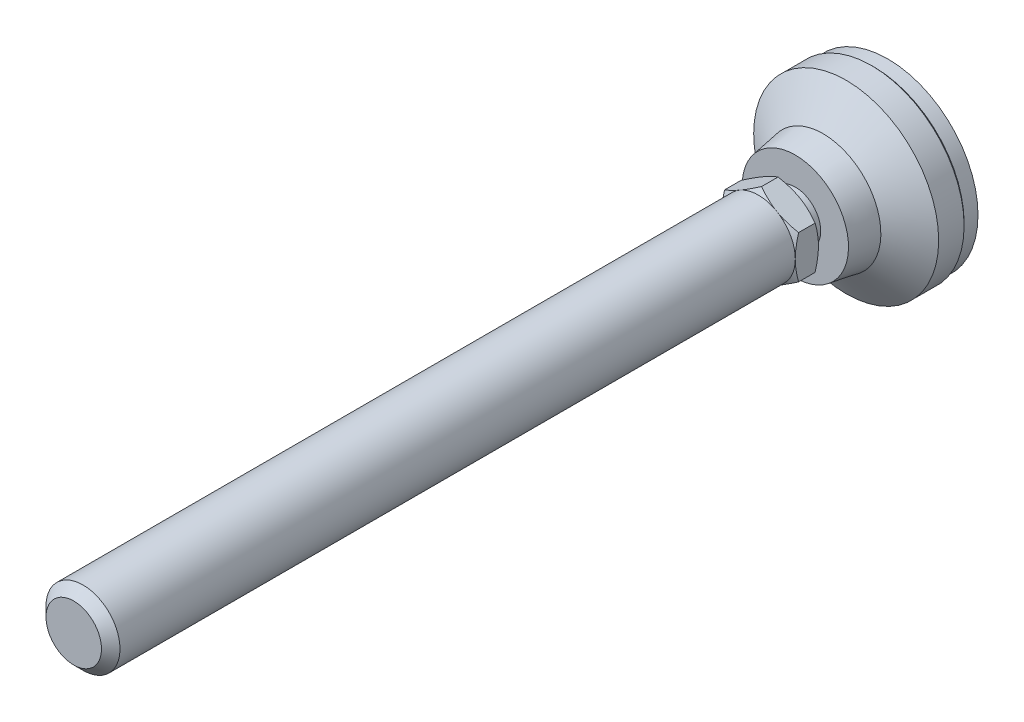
ISO-10303-21;
HEADER;
FILE_DESCRIPTION(('STEP AP214'),'2;1');
FILE_NAME('part.step','',(''),(''),'','','');
FILE_SCHEMA(('AUTOMOTIVE_DESIGN { 1 0 10303 214 1 1 1 1 }'));
ENDSEC;
DATA;
#1=APPLICATION_CONTEXT('core data for automotive mechanical design processes');
#2=APPLICATION_PROTOCOL_DEFINITION('international standard','automotive_design',2000,#1);
#3=PRODUCT_CONTEXT('',#1,'mechanical');
#4=PRODUCT('Part','Part','',(#3));
#5=PRODUCT_RELATED_PRODUCT_CATEGORY('part','',(#4));
#6=PRODUCT_DEFINITION_FORMATION('','',#4);
#7=PRODUCT_DEFINITION_CONTEXT('part definition',#1,'design');
#8=PRODUCT_DEFINITION('design','',#6,#7);
#9=PRODUCT_DEFINITION_SHAPE('','',#8);
#10=(LENGTH_UNIT() NAMED_UNIT(*) SI_UNIT(.MILLI.,.METRE.));
#11=(NAMED_UNIT(*) PLANE_ANGLE_UNIT() SI_UNIT($,.RADIAN.));
#12=(NAMED_UNIT(*) SI_UNIT($,.STERADIAN.) SOLID_ANGLE_UNIT());
#13=UNCERTAINTY_MEASURE_WITH_UNIT(LENGTH_MEASURE(1.E-05),#10,'distance_accuracy_value','');
#14=(GEOMETRIC_REPRESENTATION_CONTEXT(3) GLOBAL_UNCERTAINTY_ASSIGNED_CONTEXT((#13)) GLOBAL_UNIT_ASSIGNED_CONTEXT((#10,
#11,#12)) REPRESENTATION_CONTEXT('',''));
#15=CARTESIAN_POINT('',(0.,0.,0.));
#16=DIRECTION('',(0.,0.,1.));
#17=DIRECTION('',(1.,0.,0.));
#18=AXIS2_PLACEMENT_3D('',#15,#16,#17);
#19=CARTESIAN_POINT('',(0.,0.,2.));
#20=DIRECTION('',(0.,0.,-1.));
#21=DIRECTION('',(0.,1.,0.));
#22=AXIS2_PLACEMENT_3D('',#19,#20,#21);
#23=CYLINDRICAL_SURFACE('',#22,20.);
#24=CARTESIAN_POINT('',(0.,0.,3.5));
#25=DIRECTION('',(0.,0.,-1.));
#26=DIRECTION('',(0.,1.,0.));
#27=AXIS2_PLACEMENT_3D('',#24,#25,#26);
#28=CIRCLE('',#27,20.);
#29=CARTESIAN_POINT('',(0.,20.,3.5));
#30=VERTEX_POINT('',#29);
#31=EDGE_CURVE('E163',#30,#30,#28,.F.);
#32=ORIENTED_EDGE('',*,*,#31,.T.);
#33=EDGE_LOOP('',(#32));
#34=FACE_BOUND('',#33,.T.);
#35=CARTESIAN_POINT('',(0.,0.,9.));
#36=DIRECTION('',(0.,0.,-1.));
#37=DIRECTION('',(0.,1.,0.));
#38=AXIS2_PLACEMENT_3D('',#35,#36,#37);
#39=CIRCLE('',#38,20.);
#40=CARTESIAN_POINT('',(0.,20.,9.));
#41=VERTEX_POINT('',#40);
#42=EDGE_CURVE('E143',#41,#41,#39,.T.);
#43=ORIENTED_EDGE('',*,*,#42,.T.);
#44=EDGE_LOOP('',(#43));
#45=FACE_BOUND('',#44,.T.);
#46=ADVANCED_FACE('F14',(#34,#45),#23,.T.);
#47=CARTESIAN_POINT('',(0.,0.,2.));
#48=DIRECTION('',(0.,0.,-1.));
#49=DIRECTION('',(0.,1.,0.));
#50=AXIS2_PLACEMENT_3D('',#47,#48,#49);
#51=CYLINDRICAL_SURFACE('',#50,5.50000000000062);
#52=CARTESIAN_POINT('',(0.,0.,20.));
#53=DIRECTION('',(0.,0.,-1.));
#54=DIRECTION('',(0.,1.,0.));
#55=AXIS2_PLACEMENT_3D('',#52,#53,#54);
#56=CIRCLE('',#55,5.50000000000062);
#57=CARTESIAN_POINT('',(0.,5.50000000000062,20.));
#58=VERTEX_POINT('',#57);
#59=EDGE_CURVE('E153',#58,#58,#56,.T.);
#60=ORIENTED_EDGE('',*,*,#59,.F.);
#61=EDGE_LOOP('',(#60));
#62=FACE_BOUND('',#61,.T.);
#63=CARTESIAN_POINT('',(0.,0.,22.9999999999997));
#64=DIRECTION('',(0.,0.,-1.));
#65=DIRECTION('',(0.,1.,0.));
#66=AXIS2_PLACEMENT_3D('',#63,#64,#65);
#67=CIRCLE('',#66,5.50000000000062);
#68=CARTESIAN_POINT('',(0.,5.50000000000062,22.9999999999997));
#69=VERTEX_POINT('',#68);
#70=EDGE_CURVE('E134',#69,#69,#67,.T.);
#71=ORIENTED_EDGE('',*,*,#70,.T.);
#72=EDGE_LOOP('',(#71));
#73=FACE_BOUND('',#72,.T.);
#74=ADVANCED_FACE('F293',(#62,#73),#51,.T.);
#75=CARTESIAN_POINT('',(-11.5,0.,20.));
#76=DIRECTION('',(0.,0.,-1.));
#77=DIRECTION('',(0.,1.,0.));
#78=AXIS2_PLACEMENT_3D('',#75,#76,#77);
#79=PLANE('',#78);
#80=CARTESIAN_POINT('',(0.,0.,20.));
#81=DIRECTION('',(0.,0.,-1.));
#82=DIRECTION('',(0.,1.,0.));
#83=AXIS2_PLACEMENT_3D('',#80,#81,#82);
#84=CIRCLE('',#83,11.5);
#85=CARTESIAN_POINT('',(0.,11.5,20.));
#86=VERTEX_POINT('',#85);
#87=EDGE_CURVE('E150',#86,#86,#84,.T.);
#88=ORIENTED_EDGE('',*,*,#87,.F.);
#89=EDGE_LOOP('',(#88));
#90=FACE_BOUND('',#89,.T.);
#91=ORIENTED_EDGE('',*,*,#59,.T.);
#92=EDGE_LOOP('',(#91));
#93=FACE_BOUND('',#92,.T.);
#94=ADVANCED_FACE('F299',(#90,#93),#79,.F.);
#95=CARTESIAN_POINT('',(0.,0.,20.));
#96=DIRECTION('',(0.,0.,-1.));
#97=DIRECTION('',(0.,1.,0.));
#98=AXIS2_PLACEMENT_3D('',#95,#96,#97);
#99=CONICAL_SURFACE('',#98,11.5,0.165148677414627);
#100=CARTESIAN_POINT('',(0.,0.,14.));
#101=DIRECTION('',(0.,0.,-1.));
#102=DIRECTION('',(0.,1.,0.));
#103=AXIS2_PLACEMENT_3D('',#100,#101,#102);
#104=CIRCLE('',#103,12.5);
#105=CARTESIAN_POINT('',(0.,12.5,14.));
#106=VERTEX_POINT('',#105);
#107=EDGE_CURVE('E146',#106,#106,#104,.T.);
#108=ORIENTED_EDGE('',*,*,#107,.F.);
#109=EDGE_LOOP('',(#108));
#110=FACE_BOUND('',#109,.T.);
#111=ORIENTED_EDGE('',*,*,#87,.T.);
#112=EDGE_LOOP('',(#111));
#113=FACE_BOUND('',#112,.T.);
#114=ADVANCED_FACE('F308',(#110,#113),#99,.T.);
#115=CARTESIAN_POINT('',(0.,0.,14.));
#116=DIRECTION('',(0.,0.,-1.));
#117=DIRECTION('',(0.,1.,0.));
#118=AXIS2_PLACEMENT_3D('',#115,#116,#117);
#119=CONICAL_SURFACE('',#118,12.5,0.982793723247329);
#120=ORIENTED_EDGE('',*,*,#42,.F.);
#121=EDGE_LOOP('',(#120));
#122=FACE_BOUND('',#121,.T.);
#123=ORIENTED_EDGE('',*,*,#107,.T.);
#124=EDGE_LOOP('',(#123));
#125=FACE_BOUND('',#124,.T.);
#126=ADVANCED_FACE('F304',(#122,#125),#119,.T.);
#127=CARTESIAN_POINT('',(0.,-5.50000000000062,22.9999999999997));
#128=DIRECTION('',(0.,0.,-1.));
#129=DIRECTION('',(0.,1.,0.));
#130=AXIS2_PLACEMENT_3D('',#127,#128,#129);
#131=PLANE('',#130);
#132=CARTESIAN_POINT('',(0.,0.,22.9999999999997));
#133=DIRECTION('',(0.,0.,1.));
#134=DIRECTION('',(0.,-1.,0.));
#135=AXIS2_PLACEMENT_3D('',#132,#133,#134);
#136=CIRCLE('',#135,8.00000000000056);
#137=CARTESIAN_POINT('',(-4.,6.92820323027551,22.9999999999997));
#138=VERTEX_POINT('',#137);
#139=CARTESIAN_POINT('',(-8.,0.,22.9999999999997));
#140=VERTEX_POINT('',#139);
#141=EDGE_CURVE('E374',#138,#140,#136,.T.);
#142=ORIENTED_EDGE('',*,*,#141,.F.);
#143=CARTESIAN_POINT('',(4.,6.92820323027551,22.9999999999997));
#144=VERTEX_POINT('',#143);
#145=EDGE_CURVE('E115',#144,#138,#136,.T.);
#146=ORIENTED_EDGE('',*,*,#145,.F.);
#147=CARTESIAN_POINT('',(8.,0.,22.9999999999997));
#148=VERTEX_POINT('',#147);
#149=EDGE_CURVE('E375',#148,#144,#136,.T.);
#150=ORIENTED_EDGE('',*,*,#149,.F.);
#151=CARTESIAN_POINT('',(4.,-6.92820323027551,22.9999999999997));
#152=VERTEX_POINT('',#151);
#153=EDGE_CURVE('E35',#152,#148,#136,.T.);
#154=ORIENTED_EDGE('',*,*,#153,.F.);
#155=CARTESIAN_POINT('',(-4.,-6.92820323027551,22.9999999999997));
#156=VERTEX_POINT('',#155);
#157=EDGE_CURVE('E43',#156,#152,#136,.T.);
#158=ORIENTED_EDGE('',*,*,#157,.F.);
#159=EDGE_CURVE('E367',#140,#156,#136,.T.);
#160=ORIENTED_EDGE('',*,*,#159,.F.);
#161=EDGE_LOOP('',(#142,#146,#150,#154,#158,#160));
#162=FACE_BOUND('',#161,.T.);
#163=ORIENTED_EDGE('',*,*,#70,.F.);
#164=EDGE_LOOP('',(#163));
#165=FACE_BOUND('',#164,.T.);
#166=ADVANCED_FACE('F307',(#162,#165),#131,.T.);
#167=CARTESIAN_POINT('',(0.,0.,3.));
#168=DIRECTION('',(0.,0.,1.));
#169=DIRECTION('',(0.,-1.,0.));
#170=AXIS2_PLACEMENT_3D('',#167,#168,#169);
#171=CONICAL_SURFACE('',#170,19.5,0.785398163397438);
#172=ORIENTED_EDGE('',*,*,#31,.F.);
#173=EDGE_LOOP('',(#172));
#174=FACE_BOUND('',#173,.T.);
#175=CARTESIAN_POINT('',(0.,0.,3.));
#176=DIRECTION('',(0.,0.,-1.));
#177=DIRECTION('',(0.,1.,0.));
#178=AXIS2_PLACEMENT_3D('',#175,#176,#177);
#179=CIRCLE('',#178,19.5);
#180=CARTESIAN_POINT('',(0.,19.5,3.));
#181=VERTEX_POINT('',#180);
#182=EDGE_CURVE('E160',#181,#181,#179,.T.);
#183=ORIENTED_EDGE('',*,*,#182,.F.);
#184=EDGE_LOOP('',(#183));
#185=FACE_BOUND('',#184,.T.);
#186=ADVANCED_FACE('F16',(#174,#185),#171,.T.);
#187=CARTESIAN_POINT('',(0.,0.,0.));
#188=DIRECTION('',(0.,0.,1.));
#189=DIRECTION('',(0.,-1.,0.));
#190=AXIS2_PLACEMENT_3D('',#187,#188,#189);
#191=CYLINDRICAL_SURFACE('',#190,19.5);
#192=CARTESIAN_POINT('',(0.,0.,0.));
#193=DIRECTION('',(0.,0.,-1.));
#194=DIRECTION('',(0.,1.,0.));
#195=AXIS2_PLACEMENT_3D('',#192,#193,#194);
#196=CIRCLE('',#195,19.5);
#197=CARTESIAN_POINT('',(0.,19.5,0.));
#198=VERTEX_POINT('',#197);
#199=EDGE_CURVE('E406',#198,#198,#196,.T.);
#200=ORIENTED_EDGE('',*,*,#199,.F.);
#201=EDGE_LOOP('',(#200));
#202=FACE_BOUND('',#201,.T.);
#203=ORIENTED_EDGE('',*,*,#182,.T.);
#204=EDGE_LOOP('',(#203));
#205=FACE_BOUND('',#204,.T.);
#206=ADVANCED_FACE('F335',(#202,#205),#191,.T.);
#207=CARTESIAN_POINT('',(0.,0.,0.));
#208=DIRECTION('',(0.,0.,-1.));
#209=DIRECTION('',(0.,1.,0.));
#210=AXIS2_PLACEMENT_3D('',#207,#208,#209);
#211=PLANE('',#210);
#212=ORIENTED_EDGE('',*,*,#199,.T.);
#213=EDGE_LOOP('',(#212));
#214=FACE_BOUND('',#213,.T.);
#215=ADVANCED_FACE('F183',(#214),#211,.T.);
#216=CARTESIAN_POINT('',(0.,0.,22.9999999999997));
#217=DIRECTION('',(0.,0.,1.));
#218=DIRECTION('',(0.,-1.,0.));
#219=AXIS2_PLACEMENT_3D('',#216,#217,#218);
#220=CONICAL_SURFACE('',#219,8.00000000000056,1.0471975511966);
#221=CARTESIAN_POINT('',(-0.000199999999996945,9.23771977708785,23.7145978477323));
#222=CARTESIAN_POINT('',(0.175648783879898,9.13619343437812,23.6559907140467));
#223=CARTESIAN_POINT('',(0.352153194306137,9.03428856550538,23.6000434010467));
#224=CARTESIAN_POINT('',(0.706595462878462,8.82965122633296,23.494201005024));
#225=CARTESIAN_POINT('',(0.884533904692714,8.72691841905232,23.4443085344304));
#226=CARTESIAN_POINT('',(1.42119823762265,8.41707512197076,23.3046927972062));
#227=CARTESIAN_POINT('',(1.78204258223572,8.20874154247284,23.2252811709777));
#228=CARTESIAN_POINT('',(2.32203917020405,7.89697436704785,23.1321616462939));
#229=CARTESIAN_POINT('',(2.49957818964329,7.79447216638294,23.1056345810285));
#230=CARTESIAN_POINT('',(2.8554591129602,7.58900421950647,23.0611531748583));
#231=CARTESIAN_POINT('',(3.03380094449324,7.4860385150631,23.043198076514));
#232=CARTESIAN_POINT('',(3.3907916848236,7.27992981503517,23.0163156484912));
#233=CARTESIAN_POINT('',(3.5694400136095,7.17678715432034,23.0073780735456));
#234=CARTESIAN_POINT('',(3.92690170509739,6.97040655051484,22.9987223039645));
#235=CARTESIAN_POINT('',(4.10571506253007,6.86716861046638,22.9990038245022));
#236=CARTESIAN_POINT('',(4.44001336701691,6.67416139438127,23.0081450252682));
#237=CARTESIAN_POINT('',(4.59552190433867,6.58437849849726,23.0158896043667));
#238=CARTESIAN_POINT('',(4.90617476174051,6.40502298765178,23.0382011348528));
#239=CARTESIAN_POINT('',(5.06131905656,6.31545038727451,23.0527685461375));
#240=CARTESIAN_POINT('',(5.52615131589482,6.04707935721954,23.1063606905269));
#241=CARTESIAN_POINT('',(5.83501648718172,5.86875596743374,23.1552686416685));
#242=CARTESIAN_POINT('',(6.4560232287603,5.51021755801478,23.2775394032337));
#243=CARTESIAN_POINT('',(6.76808554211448,5.3300482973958,23.3514205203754));
#244=CARTESIAN_POINT('',(7.38755648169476,4.97239658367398,23.5191001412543));
#245=CARTESIAN_POINT('',(7.69497304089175,4.79490955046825,23.6128592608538));
#246=CARTESIAN_POINT('',(8.0002,4.61868668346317,23.7145978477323));
#247=B_SPLINE_CURVE_WITH_KNOTS('',3,(#221,#222,#223,#224,#225,#226,#227,#228,#229,#230,#231,
#232,#233,#234,#235,#236,#237,#238,#239,#240,#241,#242,#243,#244,#245,#246),.UNSPECIFIED.,.F.,
.F.,(4,2,2,2,2,2,2,2,2,2,2,2,4),(0.,0.63397354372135,1.26821965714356,2.53934712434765,
3.15934343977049,3.77928496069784,4.39852133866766,5.01773858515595,5.55680239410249,
6.09590254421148,7.17487077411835,8.27776850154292,9.37850115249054),.UNSPECIFIED.);
#248=CARTESIAN_POINT('',(0.,9.23760430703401,23.7145311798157));
#249=VERTEX_POINT('',#248);
#250=EDGE_CURVE('E112',#249,#144,#247,.T.);
#251=ORIENTED_EDGE('',*,*,#250,.T.);
#252=ORIENTED_EDGE('',*,*,#145,.T.);
#253=CARTESIAN_POINT('',(-8.0002,4.61868668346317,23.7145978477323));
#254=CARTESIAN_POINT('',(-7.8243512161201,4.7202130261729,23.6559907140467));
#255=CARTESIAN_POINT('',(-7.64784680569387,4.82211789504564,23.6000434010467));
#256=CARTESIAN_POINT('',(-7.29340453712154,5.02675523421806,23.494201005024));
#257=CARTESIAN_POINT('',(-7.11546609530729,5.1294880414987,23.4443085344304));
#258=CARTESIAN_POINT('',(-6.57880176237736,5.43933133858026,23.3046927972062));
#259=CARTESIAN_POINT('',(-6.21795741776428,5.64766491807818,23.2252811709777));
#260=CARTESIAN_POINT('',(-5.67796082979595,5.95943209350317,23.1321616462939));
#261=CARTESIAN_POINT('',(-5.50042181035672,6.06193429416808,23.1056345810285));
#262=CARTESIAN_POINT('',(-5.1445408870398,6.26740224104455,23.0611531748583));
#263=CARTESIAN_POINT('',(-4.96619905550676,6.37036794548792,23.043198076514));
#264=CARTESIAN_POINT('',(-4.60920831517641,6.57647664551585,23.0163156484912));
#265=CARTESIAN_POINT('',(-4.4305599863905,6.67961930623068,23.0073780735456));
#266=CARTESIAN_POINT('',(-4.07309829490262,6.88599991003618,22.9987223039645));
#267=CARTESIAN_POINT('',(-3.89428493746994,6.98923785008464,22.9990038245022));
#268=CARTESIAN_POINT('',(-3.5599866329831,7.18224506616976,23.0081450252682));
#269=CARTESIAN_POINT('',(-3.40447809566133,7.27202796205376,23.0158896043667));
#270=CARTESIAN_POINT('',(-3.09382523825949,7.45138347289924,23.0382011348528));
#271=CARTESIAN_POINT('',(-2.93868094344,7.54095607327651,23.0527685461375));
#272=CARTESIAN_POINT('',(-2.47384868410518,7.80932710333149,23.1063606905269));
#273=CARTESIAN_POINT('',(-2.16498351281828,7.98765049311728,23.1552686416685));
#274=CARTESIAN_POINT('',(-1.5439767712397,8.34618890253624,23.2775394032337));
#275=CARTESIAN_POINT('',(-1.23191445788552,8.52635816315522,23.3514205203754));
#276=CARTESIAN_POINT('',(-0.612443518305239,8.88400987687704,23.5191001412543));
#277=CARTESIAN_POINT('',(-0.305026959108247,9.06149691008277,23.6128592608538));
#278=CARTESIAN_POINT('',(0.000200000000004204,9.23771977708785,23.7145978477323));
#279=B_SPLINE_CURVE_WITH_KNOTS('',3,(#253,#254,#255,#256,#257,#258,#259,#260,#261,#262,#263,
#264,#265,#266,#267,#268,#269,#270,#271,#272,#273,#274,#275,#276,#277,#278),.UNSPECIFIED.,.F.,
.F.,(4,2,2,2,2,2,2,2,2,2,2,2,4),(0.,0.633973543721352,1.26821965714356,2.53934712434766,
3.15934343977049,3.77928496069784,4.39852133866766,5.01773858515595,5.55680239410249,
6.09590254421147,7.17487077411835,8.27776850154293,9.37850115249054),.UNSPECIFIED.);
#280=EDGE_CURVE('E18',#138,#249,#279,.T.);
#281=ORIENTED_EDGE('',*,*,#280,.T.);
#282=EDGE_LOOP('',(#251,#252,#281));
#283=FACE_BOUND('',#282,.T.);
#284=ADVANCED_FACE('F111',(#283),#220,.T.);
#285=CARTESIAN_POINT('',(-8.,12.3572192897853,26.8802344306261));
#286=CARTESIAN_POINT('',(-8.,12.0082237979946,26.7111397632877));
#287=CARTESIAN_POINT('',(-8.,11.6584218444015,26.5436807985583));
#288=CARTESIAN_POINT('',(-8.,10.9567759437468,26.2129552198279));
#289=CARTESIAN_POINT('',(-8.,10.604931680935,26.0496892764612));
#290=CARTESIAN_POINT('',(-8.,9.89693538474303,25.727438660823));
#291=CARTESIAN_POINT('',(-8.,9.54077029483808,25.5684825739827));
#292=CARTESIAN_POINT('',(-8.,8.82559005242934,25.2571416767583));
#293=CARTESIAN_POINT('',(-8.,8.46657503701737,25.104756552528));
#294=CARTESIAN_POINT('',(-8.,7.7337162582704,24.8036064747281));
#295=CARTESIAN_POINT('',(-8.,7.35976236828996,24.6551080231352));
#296=CARTESIAN_POINT('',(-8.,6.60746222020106,24.3694702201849));
#297=CARTESIAN_POINT('',(-8.,6.22911547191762,24.2323321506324));
#298=CARTESIAN_POINT('',(-8.,5.46814744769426,23.9730520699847));
#299=CARTESIAN_POINT('',(-8.,5.08553677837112,23.8508792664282));
#300=CARTESIAN_POINT('',(-8.,4.31484133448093,23.6254809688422));
#301=CARTESIAN_POINT('',(-8.,3.9267583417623,23.5222494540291));
#302=CARTESIAN_POINT('',(-8.,3.14698370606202,23.3402752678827));
#303=CARTESIAN_POINT('',(-8.,2.75532355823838,23.2614013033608));
#304=CARTESIAN_POINT('',(-8.,2.16430659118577,23.1647964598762));
#305=CARTESIAN_POINT('',(-8.,1.96669821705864,23.1362112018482));
#306=CARTESIAN_POINT('',(-8.,1.57051616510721,23.0868378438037));
#307=CARTESIAN_POINT('',(-8.,1.37194258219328,23.0660489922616));
#308=CARTESIAN_POINT('',(-8.,0.976668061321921,23.0329407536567));
#309=CARTESIAN_POINT('',(-8.,0.779976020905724,23.020515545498));
#310=CARTESIAN_POINT('',(-8.,0.386242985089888,23.0039905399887));
#311=CARTESIAN_POINT('',(-8.,0.189201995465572,22.999890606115));
#312=CARTESIAN_POINT('',(-8.,-0.20487713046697,23.0001138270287));
#313=CARTESIAN_POINT('',(-8.,-0.401915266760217,23.0044370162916));
#314=CARTESIAN_POINT('',(-8.,-0.795635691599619,23.0214016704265));
#315=CARTESIAN_POINT('',(-8.,-0.992317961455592,23.0340435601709));
#316=CARTESIAN_POINT('',(-8.,-1.46652689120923,23.0742864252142));
#317=CARTESIAN_POINT('',(-8.,-1.74371849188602,23.1059188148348));
#318=CARTESIAN_POINT('',(-8.,-2.29599858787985,23.1839689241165));
#319=CARTESIAN_POINT('',(-8.,-2.57108678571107,23.2303886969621));
#320=CARTESIAN_POINT('',(-8.,-3.39290836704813,23.3893637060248));
#321=CARTESIAN_POINT('',(-8.,-3.93588161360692,23.5216042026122));
#322=CARTESIAN_POINT('',(-8.,-4.74768181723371,23.7503388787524));
#323=CARTESIAN_POINT('',(-8.,-5.02073452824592,23.8326931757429));
#324=CARTESIAN_POINT('',(-8.,-5.56418702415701,24.0058114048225));
#325=CARTESIAN_POINT('',(-8.,-5.83458679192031,24.0965753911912));
#326=CARTESIAN_POINT('',(-8.,-6.37282101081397,24.2850687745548));
#327=CARTESIAN_POINT('',(-8.,-6.64065630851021,24.38279577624));
#328=CARTESIAN_POINT('',(-8.,-7.17411783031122,24.5840797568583));
#329=CARTESIAN_POINT('',(-8.,-7.43974407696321,24.6876366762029));
#330=CARTESIAN_POINT('',(-8.,-8.05256202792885,24.9330623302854));
#331=CARTESIAN_POINT('',(-8.,-8.39904052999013,25.0767082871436));
#332=CARTESIAN_POINT('',(-8.,-9.08915982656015,25.3706810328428));
#333=CARTESIAN_POINT('',(-8.,-9.43280046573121,25.5210081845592));
#334=CARTESIAN_POINT('',(-8.,-10.1177470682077,25.8270415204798));
#335=CARTESIAN_POINT('',(-8.,-10.4590525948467,25.9827486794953));
#336=CARTESIAN_POINT('',(-8.,-11.1396560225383,26.2984980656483));
#337=CARTESIAN_POINT('',(-8.,-11.4789538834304,26.4585403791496));
#338=CARTESIAN_POINT('',(-8.,-12.1561901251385,26.7823264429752));
#339=CARTESIAN_POINT('',(-8.,-12.494126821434,26.9460737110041));
#340=CARTESIAN_POINT('',(-8.,-13.1685639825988,27.2765023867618));
#341=CARTESIAN_POINT('',(-8.,-13.5050644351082,27.4431838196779));
#342=CARTESIAN_POINT('',(-8.,-14.5126638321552,27.9468287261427));
#343=CARTESIAN_POINT('',(-8.,-15.1819430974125,28.2874324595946));
#344=CARTESIAN_POINT('',(-8.,-16.4632392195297,28.9478469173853));
#345=CARTESIAN_POINT('',(-8.,-17.0755312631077,29.2671260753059));
#346=CARTESIAN_POINT('',(-8.,-18.297816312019,29.9100989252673));
#347=CARTESIAN_POINT('',(-8.,-18.9078092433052,30.233792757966));
#348=CARTESIAN_POINT('',(-8.,-20.124565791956,30.8837960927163));
#349=CARTESIAN_POINT('',(-8.,-20.7313336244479,31.2100977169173));
#350=CARTESIAN_POINT('',(-8.,-21.943390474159,31.8653623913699));
#351=CARTESIAN_POINT('',(-8.,-22.5486795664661,32.1943253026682));
#352=CARTESIAN_POINT('',(-8.,-23.1534202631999,32.5242864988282));
#353=B_SPLINE_CURVE_WITH_KNOTS('',3,(#285,#286,#287,#288,#289,#290,#291,#292,#293,#294,#295,
#296,#297,#298,#299,#300,#301,#302,#303,#304,#305,#306,#307,#308,#309,#310,#311,#312,#313,#314,
#315,#316,#317,#318,#319,#320,#321,#322,#323,#324,#325,#326,#327,#328,#329,#330,#331,#332,#333,
#334,#335,#336,#337,#338,#339,#340,#341,#342,#343,#344,#345,#346,#347,#348,#349,#350,#351,#352),
.UNSPECIFIED.,.F.,.F.,(4,2,2,2,2,2,2,2,2,2,2,2,2,2,2,2,2,2,2,2,2,2,2,2,2,2,2,2,2,2,2,2,2,4),(0.,
1.16342225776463,2.32702944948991,3.49705555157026,4.6670257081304,5.87396152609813,
7.08103333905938,8.28557820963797,9.48973953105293,10.687292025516,11.2861579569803,
11.8849661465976,12.4760478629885,13.0671198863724,13.6581943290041,14.2492989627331,
15.0857971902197,15.9224116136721,17.5965919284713,18.4521275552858,19.307668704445,
20.1629169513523,21.0181564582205,22.1432896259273,23.2684839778,24.3938832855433,
25.5193050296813,26.6458443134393,27.7723932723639,30.0252172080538,32.0968075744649,
34.1684640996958,36.2352805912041,38.3019898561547),.UNSPECIFIED.);
#354=CARTESIAN_POINT('',(-8.,4.61880215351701,23.7145311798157));
#355=VERTEX_POINT('',#354);
#356=EDGE_CURVE('E347',#140,#355,#353,.F.);
#357=ORIENTED_EDGE('',*,*,#356,.T.);
#358=EDGE_CURVE('E9',#355,#138,#279,.T.);
#359=ORIENTED_EDGE('',*,*,#358,.T.);
#360=ORIENTED_EDGE('',*,*,#141,.T.);
#361=EDGE_LOOP('',(#357,#359,#360));
#362=FACE_BOUND('',#361,.T.);
#363=ADVANCED_FACE('F181',(#362),#220,.T.);
#364=CARTESIAN_POINT('',(0.000200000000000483,-9.23771977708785,23.7145978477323));
#365=CARTESIAN_POINT('',(-0.175648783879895,-9.13619343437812,23.6559907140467));
#366=CARTESIAN_POINT('',(-0.352153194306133,-9.03428856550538,23.6000434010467));
#367=CARTESIAN_POINT('',(-0.706595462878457,-8.82965122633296,23.494201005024));
#368=CARTESIAN_POINT('',(-0.88453390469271,-8.72691841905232,23.4443085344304));
#369=CARTESIAN_POINT('',(-1.42119823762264,-8.41707512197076,23.3046927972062));
#370=CARTESIAN_POINT('',(-1.78204258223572,-8.20874154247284,23.2252811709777));
#371=CARTESIAN_POINT('',(-2.32203917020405,-7.89697436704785,23.1321616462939));
#372=CARTESIAN_POINT('',(-2.49957818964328,-7.79447216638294,23.1056345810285));
#373=CARTESIAN_POINT('',(-2.8554591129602,-7.58900421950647,23.0611531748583));
#374=CARTESIAN_POINT('',(-3.03380094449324,-7.4860385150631,23.043198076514));
#375=CARTESIAN_POINT('',(-3.39079168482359,-7.27992981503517,23.0163156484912));
#376=CARTESIAN_POINT('',(-3.5694400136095,-7.17678715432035,23.0073780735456));
#377=CARTESIAN_POINT('',(-3.92690170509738,-6.97040655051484,22.9987223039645));
#378=CARTESIAN_POINT('',(-4.10571506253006,-6.86716861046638,22.9990038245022));
#379=CARTESIAN_POINT('',(-4.4400133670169,-6.67416139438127,23.0081450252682));
#380=CARTESIAN_POINT('',(-4.59552190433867,-6.58437849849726,23.0158896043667));
#381=CARTESIAN_POINT('',(-4.90617476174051,-6.40502298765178,23.0382011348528));
#382=CARTESIAN_POINT('',(-5.06131905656,-6.31545038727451,23.0527685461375));
#383=CARTESIAN_POINT('',(-5.52615131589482,-6.04707935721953,23.1063606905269));
#384=CARTESIAN_POINT('',(-5.83501648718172,-5.86875596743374,23.1552686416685));
#385=CARTESIAN_POINT('',(-6.4560232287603,-5.51021755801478,23.2775394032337));
#386=CARTESIAN_POINT('',(-6.76808554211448,-5.3300482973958,23.3514205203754));
#387=CARTESIAN_POINT('',(-7.38755648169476,-4.97239658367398,23.5191001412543));
#388=CARTESIAN_POINT('',(-7.69497304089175,-4.79490955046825,23.6128592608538));
#389=CARTESIAN_POINT('',(-8.0002,-4.61868668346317,23.7145978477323));
#390=B_SPLINE_CURVE_WITH_KNOTS('',3,(#364,#365,#366,#367,#368,#369,#370,#371,#372,#373,#374,
#375,#376,#377,#378,#379,#380,#381,#382,#383,#384,#385,#386,#387,#388,#389),.UNSPECIFIED.,.F.,
.F.,(4,2,2,2,2,2,2,2,2,2,2,2,4),(0.,0.63397354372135,1.26821965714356,2.53934712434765,
3.15934343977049,3.77928496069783,4.39852133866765,5.01773858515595,5.55680239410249,
6.09590254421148,7.17487077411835,8.27776850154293,9.37850115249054),.UNSPECIFIED.);
#391=CARTESIAN_POINT('',(-8.,-4.618802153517,23.7145311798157));
#392=VERTEX_POINT('',#391);
#393=EDGE_CURVE('E354',#156,#392,#390,.T.);
#394=ORIENTED_EDGE('',*,*,#393,.T.);
#395=EDGE_CURVE('E353',#392,#140,#353,.F.);
#396=ORIENTED_EDGE('',*,*,#395,.T.);
#397=ORIENTED_EDGE('',*,*,#159,.T.);
#398=EDGE_LOOP('',(#394,#396,#397));
#399=FACE_BOUND('',#398,.T.);
#400=ADVANCED_FACE('F365',(#399),#220,.T.);
#401=CARTESIAN_POINT('',(8.0002,-4.61868668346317,23.7145978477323));
#402=CARTESIAN_POINT('',(7.8243512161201,-4.7202130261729,23.6559907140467));
#403=CARTESIAN_POINT('',(7.64784680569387,-4.82211789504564,23.6000434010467));
#404=CARTESIAN_POINT('',(7.29340453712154,-5.02675523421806,23.494201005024));
#405=CARTESIAN_POINT('',(7.11546609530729,-5.1294880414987,23.4443085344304));
#406=CARTESIAN_POINT('',(6.57880176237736,-5.43933133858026,23.3046927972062));
#407=CARTESIAN_POINT('',(6.21795741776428,-5.64766491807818,23.2252811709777));
#408=CARTESIAN_POINT('',(5.67796082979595,-5.95943209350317,23.1321616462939));
#409=CARTESIAN_POINT('',(5.50042181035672,-6.06193429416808,23.1056345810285));
#410=CARTESIAN_POINT('',(5.1445408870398,-6.26740224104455,23.0611531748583));
#411=CARTESIAN_POINT('',(4.96619905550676,-6.37036794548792,23.043198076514));
#412=CARTESIAN_POINT('',(4.60920831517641,-6.57647664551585,23.0163156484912));
#413=CARTESIAN_POINT('',(4.4305599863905,-6.67961930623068,23.0073780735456));
#414=CARTESIAN_POINT('',(4.07309829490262,-6.88599991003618,22.9987223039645));
#415=CARTESIAN_POINT('',(3.89428493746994,-6.98923785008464,22.9990038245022));
#416=CARTESIAN_POINT('',(3.5599866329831,-7.18224506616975,23.0081450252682));
#417=CARTESIAN_POINT('',(3.40447809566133,-7.27202796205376,23.0158896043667));
#418=CARTESIAN_POINT('',(3.09382523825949,-7.45138347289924,23.0382011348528));
#419=CARTESIAN_POINT('',(2.93868094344,-7.54095607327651,23.0527685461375));
#420=CARTESIAN_POINT('',(2.47384868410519,-7.80932710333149,23.1063606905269));
#421=CARTESIAN_POINT('',(2.16498351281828,-7.98765049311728,23.1552686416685));
#422=CARTESIAN_POINT('',(1.5439767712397,-8.34618890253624,23.2775394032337));
#423=CARTESIAN_POINT('',(1.23191445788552,-8.52635816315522,23.3514205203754));
#424=CARTESIAN_POINT('',(0.612443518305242,-8.88400987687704,23.5191001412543));
#425=CARTESIAN_POINT('',(0.305026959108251,-9.06149691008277,23.6128592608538));
#426=CARTESIAN_POINT('',(-0.000199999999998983,-9.23771977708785,23.7145978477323));
#427=B_SPLINE_CURVE_WITH_KNOTS('',3,(#401,#402,#403,#404,#405,#406,#407,#408,#409,#410,#411,
#412,#413,#414,#415,#416,#417,#418,#419,#420,#421,#422,#423,#424,#425,#426),.UNSPECIFIED.,.F.,
.F.,(4,2,2,2,2,2,2,2,2,2,2,2,4),(0.,0.633973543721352,1.26821965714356,2.53934712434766,
3.15934343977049,3.77928496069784,4.39852133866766,5.01773858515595,5.55680239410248,
6.09590254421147,7.17487077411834,8.27776850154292,9.37850115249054),.UNSPECIFIED.);
#428=CARTESIAN_POINT('',(0.,-9.23760430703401,23.7145311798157));
#429=VERTEX_POINT('',#428);
#430=EDGE_CURVE('E244',#152,#429,#427,.T.);
#431=ORIENTED_EDGE('',*,*,#430,.T.);
#432=EDGE_CURVE('E359',#429,#156,#390,.T.);
#433=ORIENTED_EDGE('',*,*,#432,.T.);
#434=ORIENTED_EDGE('',*,*,#157,.T.);
#435=EDGE_LOOP('',(#431,#433,#434));
#436=FACE_BOUND('',#435,.T.);
#437=ADVANCED_FACE('F390',(#436),#220,.T.);
#438=CARTESIAN_POINT('',(8.,12.3572192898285,26.880234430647));
#439=CARTESIAN_POINT('',(8.,12.0082237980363,26.7111397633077));
#440=CARTESIAN_POINT('',(8.,11.6584218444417,26.5436807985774));
#441=CARTESIAN_POINT('',(8.,10.9567759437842,26.2129552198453));
#442=CARTESIAN_POINT('',(8.,10.6049316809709,26.0496892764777));
#443=CARTESIAN_POINT('',(8.,9.896935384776,25.7274386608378));
#444=CARTESIAN_POINT('',(8.,9.54077029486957,25.5684825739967));
#445=CARTESIAN_POINT('',(8.,8.82559005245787,25.2571416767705));
#446=CARTESIAN_POINT('',(8.,8.46657503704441,25.1047565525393));
#447=CARTESIAN_POINT('',(8.,7.73371625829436,24.8036064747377));
#448=CARTESIAN_POINT('',(8.,7.35976236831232,24.6551080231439));
#449=CARTESIAN_POINT('',(8.,6.60746222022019,24.3694702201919));
#450=CARTESIAN_POINT('',(8.,6.22911547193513,24.2323321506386));
#451=CARTESIAN_POINT('',(8.,5.46814744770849,23.9730520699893));
#452=CARTESIAN_POINT('',(8.,5.0855367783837,23.8508792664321));
#453=CARTESIAN_POINT('',(8.,4.31484133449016,23.6254809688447));
#454=CARTESIAN_POINT('',(8.,3.92675834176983,23.522249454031));
#455=CARTESIAN_POINT('',(8.,3.14698370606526,23.3402752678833));
#456=CARTESIAN_POINT('',(8.,2.75532355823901,23.2614013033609));
#457=CARTESIAN_POINT('',(8.,2.16430659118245,23.1647964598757));
#458=CARTESIAN_POINT('',(8.,1.96669821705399,23.1362112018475));
#459=CARTESIAN_POINT('',(8.,1.57051616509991,23.0868378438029));
#460=CARTESIAN_POINT('',(8.,1.37194258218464,23.0660489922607));
#461=CARTESIAN_POINT('',(8.,0.976668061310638,23.0329407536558));
#462=CARTESIAN_POINT('',(8.,0.779976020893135,23.0205155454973));
#463=CARTESIAN_POINT('',(8.,0.386242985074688,23.0039905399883));
#464=CARTESIAN_POINT('',(8.,0.189201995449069,22.9998906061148));
#465=CARTESIAN_POINT('',(8.,-0.204877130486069,23.0001138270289));
#466=CARTESIAN_POINT('',(8.,-0.401915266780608,23.0044370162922));
#467=CARTESIAN_POINT('',(8.,-0.795635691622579,23.0214016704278));
#468=CARTESIAN_POINT('',(8.,-0.992317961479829,23.0340435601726));
#469=CARTESIAN_POINT('',(8.,-1.46652689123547,23.0742864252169));
#470=CARTESIAN_POINT('',(8.,-1.74371849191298,23.1059188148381));
#471=CARTESIAN_POINT('',(8.,-2.29599858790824,23.183968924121));
#472=CARTESIAN_POINT('',(8.,-2.57108678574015,23.2303886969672));
#473=CARTESIAN_POINT('',(8.,-3.39290836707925,23.3893637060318));
#474=CARTESIAN_POINT('',(8.,-3.93588161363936,23.5216042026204));
#475=CARTESIAN_POINT('',(8.,-4.74768181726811,23.7503388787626));
#476=CARTESIAN_POINT('',(8.,-5.02073452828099,23.8326931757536));
#477=CARTESIAN_POINT('',(8.,-5.56418702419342,24.0058114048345));
#478=CARTESIAN_POINT('',(8.,-5.83458679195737,24.0965753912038));
#479=CARTESIAN_POINT('',(8.,-6.37282101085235,24.2850687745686));
#480=CARTESIAN_POINT('',(8.,-6.64065630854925,24.3827957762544));
#481=CARTESIAN_POINT('',(8.,-7.17411783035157,24.5840797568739));
#482=CARTESIAN_POINT('',(8.,-7.43974407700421,24.687636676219));
#483=CARTESIAN_POINT('',(8.,-8.05256202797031,24.9330623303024));
#484=CARTESIAN_POINT('',(8.,-8.39904053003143,25.0767082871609));
#485=CARTESIAN_POINT('',(8.,-9.08915982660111,25.3706810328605));
#486=CARTESIAN_POINT('',(8.,-9.43280046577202,25.5210081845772));
#487=CARTESIAN_POINT('',(8.,-10.1177470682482,25.8270415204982));
#488=CARTESIAN_POINT('',(8.,-10.4590525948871,25.9827486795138));
#489=CARTESIAN_POINT('',(8.,-11.1396560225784,26.2984980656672));
#490=CARTESIAN_POINT('',(8.,-11.4789538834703,26.4585403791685));
#491=CARTESIAN_POINT('',(8.,-12.1561901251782,26.7823264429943));
#492=CARTESIAN_POINT('',(8.,-12.4941268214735,26.9460737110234));
#493=CARTESIAN_POINT('',(8.,-13.1685639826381,27.2765023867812));
#494=CARTESIAN_POINT('',(8.,-13.5050644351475,27.4431838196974));
#495=CARTESIAN_POINT('',(8.,-14.5126638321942,27.9468287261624));
#496=CARTESIAN_POINT('',(8.,-15.1819430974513,28.2874324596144));
#497=CARTESIAN_POINT('',(8.,-16.4632392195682,28.9478469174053));
#498=CARTESIAN_POINT('',(8.,-17.0755312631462,29.2671260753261));
#499=CARTESIAN_POINT('',(8.,-18.2978163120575,29.9100989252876));
#500=CARTESIAN_POINT('',(7.99999999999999,-18.9078092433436,30.2337927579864));
#501=CARTESIAN_POINT('',(7.99999999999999,-20.1245657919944,30.8837960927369));
#502=CARTESIAN_POINT('',(7.99999999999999,-20.7313336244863,31.210097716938));
#503=CARTESIAN_POINT('',(7.99999999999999,-21.9433904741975,31.8653623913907));
#504=CARTESIAN_POINT('',(8.,-22.5486795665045,32.1943253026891));
#505=CARTESIAN_POINT('',(8.,-23.1534202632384,32.5242864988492));
#506=B_SPLINE_CURVE_WITH_KNOTS('',3,(#438,#439,#440,#441,#442,#443,#444,#445,#446,#447,#448,
#449,#450,#451,#452,#453,#454,#455,#456,#457,#458,#459,#460,#461,#462,#463,#464,#465,#466,#467,
#468,#469,#470,#471,#472,#473,#474,#475,#476,#477,#478,#479,#480,#481,#482,#483,#484,#485,#486,
#487,#488,#489,#490,#491,#492,#493,#494,#495,#496,#497,#498,#499,#500,#501,#502,#503,#504,#505),
.UNSPECIFIED.,.F.,.F.,(4,2,2,2,2,2,2,2,2,2,2,2,2,2,2,2,2,2,2,2,2,2,2,2,2,2,2,2,2,2,2,2,2,4),(0.,
1.16342225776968,2.32702944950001,3.49705555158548,4.66702570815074,5.87396152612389,
7.08103333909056,8.28557820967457,9.48973953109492,10.687292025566,11.2861579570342,
11.8849661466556,12.4760478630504,13.0671198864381,13.6581943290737,14.2492989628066,
15.0857971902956,15.9224116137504,17.5965919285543,18.4521275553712,19.3076687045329,
20.1629169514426,21.0181564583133,22.14328962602,23.2684839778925,24.3938832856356,
25.5193050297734,26.6458443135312,27.7723932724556,30.0252172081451,32.0968075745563,
34.1684640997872,36.2352805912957,38.3019898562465),.UNSPECIFIED.);
#507=CARTESIAN_POINT('',(8.,-4.61880215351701,23.7145311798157));
#508=VERTEX_POINT('',#507);
#509=EDGE_CURVE('E236',#148,#508,#506,.T.);
#510=ORIENTED_EDGE('',*,*,#509,.T.);
#511=EDGE_CURVE('E243',#508,#152,#427,.T.);
#512=ORIENTED_EDGE('',*,*,#511,.T.);
#513=ORIENTED_EDGE('',*,*,#153,.T.);
#514=EDGE_LOOP('',(#510,#512,#513));
#515=FACE_BOUND('',#514,.T.);
#516=ADVANCED_FACE('F384',(#515),#220,.T.);
#517=CARTESIAN_POINT('',(8.,4.61880215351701,23.7145311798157));
#518=VERTEX_POINT('',#517);
#519=EDGE_CURVE('E127',#144,#518,#247,.T.);
#520=ORIENTED_EDGE('',*,*,#519,.T.);
#521=EDGE_CURVE('E242',#518,#148,#506,.T.);
#522=ORIENTED_EDGE('',*,*,#521,.T.);
#523=ORIENTED_EDGE('',*,*,#149,.T.);
#524=EDGE_LOOP('',(#520,#522,#523));
#525=FACE_BOUND('',#524,.T.);
#526=ADVANCED_FACE('F330',(#525),#220,.T.);
#527=CARTESIAN_POINT('',(0.,0.,176.));
#528=DIRECTION('',(0.,0.,-1.));
#529=DIRECTION('',(0.,1.,0.));
#530=AXIS2_PLACEMENT_3D('',#527,#528,#529);
#531=PLANE('',#530);
#532=CARTESIAN_POINT('',(0.,0.,176.));
#533=DIRECTION('',(0.,0.,-1.));
#534=DIRECTION('',(0.,1.,0.));
#535=AXIS2_PLACEMENT_3D('',#532,#533,#534);
#536=CIRCLE('',#535,6.00000000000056);
#537=CARTESIAN_POINT('',(0.,6.00000000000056,176.));
#538=VERTEX_POINT('',#537);
#539=EDGE_CURVE('E139',#538,#538,#536,.T.);
#540=ORIENTED_EDGE('',*,*,#539,.F.);
#541=EDGE_LOOP('',(#540));
#542=FACE_BOUND('',#541,.T.);
#543=ADVANCED_FACE('F323',(#542),#531,.F.);
#544=CARTESIAN_POINT('',(0.,0.,176.));
#545=DIRECTION('',(0.,0.,-1.));
#546=DIRECTION('',(0.,1.,0.));
#547=AXIS2_PLACEMENT_3D('',#544,#545,#546);
#548=CONICAL_SURFACE('',#547,6.00000000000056,0.785398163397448);
#549=CARTESIAN_POINT('',(0.,0.,174.));
#550=DIRECTION('',(0.,0.,-1.));
#551=DIRECTION('',(0.,1.,0.));
#552=AXIS2_PLACEMENT_3D('',#549,#550,#551);
#553=CIRCLE('',#552,8.00000000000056);
#554=CARTESIAN_POINT('',(0.,8.00000000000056,174.));
#555=VERTEX_POINT('',#554);
#556=EDGE_CURVE('E404',#555,#555,#553,.T.);
#557=ORIENTED_EDGE('',*,*,#556,.F.);
#558=EDGE_LOOP('',(#557));
#559=FACE_BOUND('',#558,.T.);
#560=ORIENTED_EDGE('',*,*,#539,.T.);
#561=EDGE_LOOP('',(#560));
#562=FACE_BOUND('',#561,.T.);
#563=ADVANCED_FACE('F316',(#559,#562),#548,.T.);
#564=CARTESIAN_POINT('',(0.,0.,2.));
#565=DIRECTION('',(0.,0.,-1.));
#566=DIRECTION('',(0.,1.,0.));
#567=AXIS2_PLACEMENT_3D('',#564,#565,#566);
#568=CYLINDRICAL_SURFACE('',#567,8.00000000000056);
#569=CARTESIAN_POINT('',(0.,0.,28.));
#570=DIRECTION('',(0.,0.,-1.));
#571=DIRECTION('',(0.,1.,0.));
#572=AXIS2_PLACEMENT_3D('',#569,#570,#571);
#573=CIRCLE('',#572,8.00000000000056);
#574=CARTESIAN_POINT('',(4.,6.92820323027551,28.));
#575=VERTEX_POINT('',#574);
#576=CARTESIAN_POINT('',(8.,0.,28.));
#577=VERTEX_POINT('',#576);
#578=EDGE_CURVE('E159',#575,#577,#573,.T.);
#579=ORIENTED_EDGE('',*,*,#578,.F.);
#580=CARTESIAN_POINT('',(-4.,6.92820323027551,28.));
#581=VERTEX_POINT('',#580);
#582=EDGE_CURVE('E156',#581,#575,#573,.T.);
#583=ORIENTED_EDGE('',*,*,#582,.F.);
#584=CARTESIAN_POINT('',(-8.,0.,28.));
#585=VERTEX_POINT('',#584);
#586=EDGE_CURVE('E158',#585,#581,#573,.T.);
#587=ORIENTED_EDGE('',*,*,#586,.F.);
#588=CARTESIAN_POINT('',(-4.,-6.92820323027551,28.));
#589=VERTEX_POINT('',#588);
#590=EDGE_CURVE('E281',#589,#585,#573,.T.);
#591=ORIENTED_EDGE('',*,*,#590,.F.);
#592=CARTESIAN_POINT('',(4.,-6.92820323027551,28.));
#593=VERTEX_POINT('',#592);
#594=EDGE_CURVE('E280',#593,#589,#573,.T.);
#595=ORIENTED_EDGE('',*,*,#594,.F.);
#596=CARTESIAN_POINT('',(0.,0.,28.));
#597=DIRECTION('',(0.,0.,1.));
#598=DIRECTION('',(0.,-1.,0.));
#599=AXIS2_PLACEMENT_3D('',#596,#597,#598);
#600=CIRCLE('',#599,8.00000000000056);
#601=EDGE_CURVE('E128',#593,#577,#600,.T.);
#602=ORIENTED_EDGE('',*,*,#601,.T.);
#603=EDGE_LOOP('',(#579,#583,#587,#591,#595,#602));
#604=FACE_BOUND('',#603,.T.);
#605=ORIENTED_EDGE('',*,*,#556,.T.);
#606=EDGE_LOOP('',(#605));
#607=FACE_BOUND('',#606,.T.);
#608=ADVANCED_FACE('F277',(#604,#607),#568,.T.);
#609=CARTESIAN_POINT('',(0.,0.,26.5129471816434));
#610=DIRECTION('',(0.,0.,-1.));
#611=DIRECTION('',(0.,1.,0.));
#612=AXIS2_PLACEMENT_3D('',#609,#610,#611);
#613=CONICAL_SURFACE('',#612,10.5756510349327,1.0471975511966);
#614=CARTESIAN_POINT('',(8.,12.3572192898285,24.1197655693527));
#615=CARTESIAN_POINT('',(8.,12.0082237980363,24.288860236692));
#616=CARTESIAN_POINT('',(8.,11.6584218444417,24.4563192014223));
#617=CARTESIAN_POINT('',(8.,10.9567759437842,24.7870447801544));
#618=CARTESIAN_POINT('',(8.,10.6049316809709,24.950310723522));
#619=CARTESIAN_POINT('',(8.,9.896935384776,25.2725613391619));
#620=CARTESIAN_POINT('',(8.,9.54077029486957,25.431517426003));
#621=CARTESIAN_POINT('',(8.,8.82559005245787,25.7428583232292));
#622=CARTESIAN_POINT('',(8.,8.46657503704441,25.8952434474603));
#623=CARTESIAN_POINT('',(8.,7.73371625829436,26.196393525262));
#624=CARTESIAN_POINT('',(8.,7.35976236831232,26.3448919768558));
#625=CARTESIAN_POINT('',(8.,6.60746222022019,26.6305297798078));
#626=CARTESIAN_POINT('',(8.,6.22911547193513,26.7676678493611));
#627=CARTESIAN_POINT('',(8.,5.4681474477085,27.0269479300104));
#628=CARTESIAN_POINT('',(8.,5.0855367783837,27.1491207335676));
#629=CARTESIAN_POINT('',(8.,4.31484133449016,27.374519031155));
#630=CARTESIAN_POINT('',(8.,3.92675834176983,27.4777505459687));
#631=CARTESIAN_POINT('',(8.,3.14698370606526,27.6597247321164));
#632=CARTESIAN_POINT('',(8.,2.75532355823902,27.7385986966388));
#633=CARTESIAN_POINT('',(8.,2.16430659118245,27.835203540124));
#634=CARTESIAN_POINT('',(8.,1.96669821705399,27.8637887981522));
#635=CARTESIAN_POINT('',(8.,1.57051616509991,27.9131621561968));
#636=CARTESIAN_POINT('',(8.,1.37194258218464,27.933951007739));
#637=CARTESIAN_POINT('',(8.,0.97666806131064,27.9670592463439));
#638=CARTESIAN_POINT('',(8.,0.779976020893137,27.9794844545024));
#639=CARTESIAN_POINT('',(8.,0.386242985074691,27.9960094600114));
#640=CARTESIAN_POINT('',(8.,0.189201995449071,28.0001093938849));
#641=CARTESIAN_POINT('',(8.,-0.204877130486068,27.9998861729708));
#642=CARTESIAN_POINT('',(8.,-0.401915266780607,27.9955629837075));
#643=CARTESIAN_POINT('',(8.,-0.795635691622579,27.9785983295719));
#644=CARTESIAN_POINT('',(8.,-0.992317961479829,27.9659564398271));
#645=CARTESIAN_POINT('',(8.,-1.46652689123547,27.9257135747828));
#646=CARTESIAN_POINT('',(8.,-1.74371849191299,27.8940811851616));
#647=CARTESIAN_POINT('',(8.,-2.29599858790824,27.8160310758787));
#648=CARTESIAN_POINT('',(8.,-2.57108678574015,27.7696113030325));
#649=CARTESIAN_POINT('',(8.,-3.39290836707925,27.6106362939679));
#650=CARTESIAN_POINT('',(8.,-3.93588161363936,27.4783957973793));
#651=CARTESIAN_POINT('',(8.,-4.74768181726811,27.2496611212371));
#652=CARTESIAN_POINT('',(8.,-5.02073452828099,27.1673068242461));
#653=CARTESIAN_POINT('',(8.,-5.56418702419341,26.9941885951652));
#654=CARTESIAN_POINT('',(8.,-5.83458679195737,26.9034246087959));
#655=CARTESIAN_POINT('',(8.,-6.37282101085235,26.7149312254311));
#656=CARTESIAN_POINT('',(8.,-6.64065630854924,26.6172042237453));
#657=CARTESIAN_POINT('',(8.,-7.17411783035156,26.4159202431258));
#658=CARTESIAN_POINT('',(8.,-7.4397440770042,26.3123633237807));
#659=CARTESIAN_POINT('',(8.,-8.0525620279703,26.0669376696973));
#660=CARTESIAN_POINT('',(8.,-8.39904053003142,25.9232917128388));
#661=CARTESIAN_POINT('',(8.,-9.0891598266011,25.6293189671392));
#662=CARTESIAN_POINT('',(8.,-9.432800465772,25.4789918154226));
#663=CARTESIAN_POINT('',(8.,-10.1177470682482,25.1729584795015));
#664=CARTESIAN_POINT('',(8.,-10.4590525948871,25.0172513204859));
#665=CARTESIAN_POINT('',(8.,-11.1396560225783,24.7015019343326));
#666=CARTESIAN_POINT('',(8.,-11.4789538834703,24.5414596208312));
#667=CARTESIAN_POINT('',(8.,-12.1561901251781,24.2176735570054));
#668=CARTESIAN_POINT('',(8.,-12.4941268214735,24.0539262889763));
#669=CARTESIAN_POINT('',(8.,-13.1685639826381,23.7234976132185));
#670=CARTESIAN_POINT('',(8.,-13.5050644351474,23.5568161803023));
#671=CARTESIAN_POINT('',(8.,-14.5126638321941,23.0531712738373));
#672=CARTESIAN_POINT('',(8.,-15.1819430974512,22.7125675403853));
#673=CARTESIAN_POINT('',(8.,-16.4632392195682,22.0521530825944));
#674=CARTESIAN_POINT('',(8.,-17.0755312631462,21.7328739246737));
#675=CARTESIAN_POINT('',(8.,-18.2978163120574,21.0899010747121));
#676=CARTESIAN_POINT('',(7.99999999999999,-18.9078092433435,20.7662072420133));
#677=CARTESIAN_POINT('',(7.99999999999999,-20.1245657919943,20.1162039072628));
#678=CARTESIAN_POINT('',(7.99999999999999,-20.7313336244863,19.7899022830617));
#679=CARTESIAN_POINT('',(7.99999999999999,-21.9433904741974,19.134637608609));
#680=CARTESIAN_POINT('',(8.,-22.5486795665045,18.8056746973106));
#681=CARTESIAN_POINT('',(8.,-23.1534202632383,18.4757135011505));
#682=B_SPLINE_CURVE_WITH_KNOTS('',3,(#614,#615,#616,#617,#618,#619,#620,#621,#622,#623,#624,
#625,#626,#627,#628,#629,#630,#631,#632,#633,#634,#635,#636,#637,#638,#639,#640,#641,#642,#643,
#644,#645,#646,#647,#648,#649,#650,#651,#652,#653,#654,#655,#656,#657,#658,#659,#660,#661,#662,
#663,#664,#665,#666,#667,#668,#669,#670,#671,#672,#673,#674,#675,#676,#677,#678,#679,#680,#681),
.UNSPECIFIED.,.F.,.F.,(4,2,2,2,2,2,2,2,2,2,2,2,2,2,2,2,2,2,2,2,2,2,2,2,2,2,2,2,2,2,2,2,2,4),(0.,
1.16342225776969,2.32702944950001,3.49705555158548,4.66702570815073,5.87396152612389,
7.08103333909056,8.28557820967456,9.48973953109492,10.687292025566,11.2861579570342,
11.8849661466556,12.4760478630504,13.0671198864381,13.6581943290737,14.2492989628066,
15.0857971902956,15.9224116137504,17.5965919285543,18.4521275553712,19.3076687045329,
20.1629169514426,21.0181564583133,22.14328962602,23.2684839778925,24.3938832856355,
25.5193050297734,26.6458443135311,27.7723932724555,30.0252172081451,32.0968075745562,
34.1684640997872,36.2352805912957,38.3019898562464),.UNSPECIFIED.);
#683=CARTESIAN_POINT('',(8.,4.61880215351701,27.285468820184));
#684=VERTEX_POINT('',#683);
#685=EDGE_CURVE('E213',#577,#684,#682,.F.);
#686=ORIENTED_EDGE('',*,*,#685,.T.);
#687=CARTESIAN_POINT('',(8.0002,4.61868668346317,27.2854021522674));
#688=CARTESIAN_POINT('',(7.8243512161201,4.7202130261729,27.344009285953));
#689=CARTESIAN_POINT('',(7.64784680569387,4.82211789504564,27.399956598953));
#690=CARTESIAN_POINT('',(7.29340453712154,5.02675523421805,27.5057989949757));
#691=CARTESIAN_POINT('',(7.11546609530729,5.1294880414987,27.5556914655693));
#692=CARTESIAN_POINT('',(6.57880176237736,5.43933133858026,27.6953072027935));
#693=CARTESIAN_POINT('',(6.21795741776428,5.64766491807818,27.774718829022));
#694=CARTESIAN_POINT('',(5.67796082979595,5.95943209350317,27.8678383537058));
#695=CARTESIAN_POINT('',(5.50042181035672,6.06193429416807,27.8943654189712));
#696=CARTESIAN_POINT('',(5.1445408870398,6.26740224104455,27.9388468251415));
#697=CARTESIAN_POINT('',(4.96619905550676,6.37036794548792,27.9568019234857));
#698=CARTESIAN_POINT('',(4.60920831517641,6.57647664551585,27.9836843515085));
#699=CARTESIAN_POINT('',(4.4305599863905,6.67961930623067,27.9926219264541));
#700=CARTESIAN_POINT('',(4.07309829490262,6.88599991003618,28.0012776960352));
#701=CARTESIAN_POINT('',(3.89428493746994,6.98923785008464,28.0009961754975));
#702=CARTESIAN_POINT('',(3.5599866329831,7.18224506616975,27.9918549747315));
#703=CARTESIAN_POINT('',(3.40447809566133,7.27202796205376,27.984110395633));
#704=CARTESIAN_POINT('',(3.09382523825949,7.45138347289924,27.9617988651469));
#705=CARTESIAN_POINT('',(2.93868094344,7.54095607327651,27.9472314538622));
#706=CARTESIAN_POINT('',(2.47384868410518,7.80932710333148,27.8936393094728));
#707=CARTESIAN_POINT('',(2.16498351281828,7.98765049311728,27.8447313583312));
#708=CARTESIAN_POINT('',(1.5439767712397,8.34618890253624,27.722460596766));
#709=CARTESIAN_POINT('',(1.23191445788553,8.52635816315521,27.6485794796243));
#710=CARTESIAN_POINT('',(0.612443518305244,8.88400987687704,27.4808998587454));
#711=CARTESIAN_POINT('',(0.305026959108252,9.06149691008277,27.3871407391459));
#712=CARTESIAN_POINT('',(-0.000199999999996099,9.23771977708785,27.2854021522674));
#713=B_SPLINE_CURVE_WITH_KNOTS('',3,(#687,#688,#689,#690,#691,#692,#693,#694,#695,#696,#697,
#698,#699,#700,#701,#702,#703,#704,#705,#706,#707,#708,#709,#710,#711,#712),.UNSPECIFIED.,.F.,
.F.,(4,2,2,2,2,2,2,2,2,2,2,2,4),(0.,0.633973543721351,1.26821965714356,2.53934712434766,
3.15934343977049,3.77928496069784,4.39852133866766,5.01773858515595,5.55680239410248,
6.09590254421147,7.17487077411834,8.27776850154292,9.37850115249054),.UNSPECIFIED.);
#714=EDGE_CURVE('E263',#684,#575,#713,.T.);
#715=ORIENTED_EDGE('',*,*,#714,.T.);
#716=ORIENTED_EDGE('',*,*,#578,.T.);
#717=EDGE_LOOP('',(#686,#715,#716));
#718=FACE_BOUND('',#717,.T.);
#719=ADVANCED_FACE('F271',(#718),#613,.T.);
#720=CARTESIAN_POINT('',(-0.0002,-9.23771977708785,27.2854021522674));
#721=CARTESIAN_POINT('',(0.175648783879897,-9.13619343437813,27.344009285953));
#722=CARTESIAN_POINT('',(0.352153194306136,-9.03428856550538,27.399956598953));
#723=CARTESIAN_POINT('',(0.706595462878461,-8.82965122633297,27.5057989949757));
#724=CARTESIAN_POINT('',(0.884533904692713,-8.72691841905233,27.5556914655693));
#725=CARTESIAN_POINT('',(1.42119823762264,-8.41707512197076,27.6953072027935));
#726=CARTESIAN_POINT('',(1.78204258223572,-8.20874154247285,27.774718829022));
#727=CARTESIAN_POINT('',(2.32203917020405,-7.89697436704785,27.8678383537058));
#728=CARTESIAN_POINT('',(2.49957818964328,-7.79447216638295,27.8943654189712));
#729=CARTESIAN_POINT('',(2.8554591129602,-7.58900421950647,27.9388468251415));
#730=CARTESIAN_POINT('',(3.03380094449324,-7.4860385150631,27.9568019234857));
#731=CARTESIAN_POINT('',(3.39079168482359,-7.27992981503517,27.9836843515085));
#732=CARTESIAN_POINT('',(3.5694400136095,-7.17678715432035,27.9926219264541));
#733=CARTESIAN_POINT('',(3.92690170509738,-6.97040655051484,28.0012776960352));
#734=CARTESIAN_POINT('',(4.10571506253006,-6.86716861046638,28.0009961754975));
#735=CARTESIAN_POINT('',(4.4400133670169,-6.67416139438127,27.9918549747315));
#736=CARTESIAN_POINT('',(4.59552190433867,-6.58437849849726,27.984110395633));
#737=CARTESIAN_POINT('',(4.90617476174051,-6.40502298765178,27.9617988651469));
#738=CARTESIAN_POINT('',(5.06131905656,-6.31545038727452,27.9472314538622));
#739=CARTESIAN_POINT('',(5.52615131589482,-6.04707935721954,27.8936393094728));
#740=CARTESIAN_POINT('',(5.83501648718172,-5.86875596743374,27.8447313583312));
#741=CARTESIAN_POINT('',(6.4560232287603,-5.51021755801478,27.722460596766));
#742=CARTESIAN_POINT('',(6.76808554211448,-5.33004829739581,27.6485794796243));
#743=CARTESIAN_POINT('',(7.38755648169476,-4.97239658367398,27.4808998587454));
#744=CARTESIAN_POINT('',(7.69497304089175,-4.79490955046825,27.3871407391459));
#745=CARTESIAN_POINT('',(8.0002,-4.61868668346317,27.2854021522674));
#746=B_SPLINE_CURVE_WITH_KNOTS('',3,(#720,#721,#722,#723,#724,#725,#726,#727,#728,#729,#730,
#731,#732,#733,#734,#735,#736,#737,#738,#739,#740,#741,#742,#743,#744,#745),.UNSPECIFIED.,.F.,
.F.,(4,2,2,2,2,2,2,2,2,2,2,2,4),(0.,0.63397354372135,1.26821965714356,2.53934712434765,
3.15934343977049,3.77928496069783,4.39852133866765,5.01773858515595,5.55680239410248,
6.09590254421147,7.17487077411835,8.27776850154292,9.37850115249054),.UNSPECIFIED.);
#747=CARTESIAN_POINT('',(8.,-4.61880215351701,27.285468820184));
#748=VERTEX_POINT('',#747);
#749=EDGE_CURVE('E220',#593,#748,#746,.T.);
#750=ORIENTED_EDGE('',*,*,#749,.T.);
#751=EDGE_CURVE('E219',#748,#577,#682,.F.);
#752=ORIENTED_EDGE('',*,*,#751,.T.);
#753=ORIENTED_EDGE('',*,*,#601,.F.);
#754=EDGE_LOOP('',(#750,#752,#753));
#755=FACE_BOUND('',#754,.T.);
#756=ADVANCED_FACE('F322',(#755),#613,.T.);
#757=CARTESIAN_POINT('',(0.,-9.23760430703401,27.285468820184));
#758=VERTEX_POINT('',#757);
#759=EDGE_CURVE('E396',#758,#593,#746,.T.);
#760=ORIENTED_EDGE('',*,*,#759,.T.);
#761=ORIENTED_EDGE('',*,*,#594,.T.);
#762=CARTESIAN_POINT('',(-8.0002,-4.61868668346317,27.2854021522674));
#763=CARTESIAN_POINT('',(-7.8243512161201,-4.7202130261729,27.344009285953));
#764=CARTESIAN_POINT('',(-7.64784680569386,-4.82211789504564,27.399956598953));
#765=CARTESIAN_POINT('',(-7.29340453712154,-5.02675523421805,27.5057989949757));
#766=CARTESIAN_POINT('',(-7.11546609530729,-5.12948804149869,27.5556914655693));
#767=CARTESIAN_POINT('',(-6.57880176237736,-5.43933133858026,27.6953072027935));
#768=CARTESIAN_POINT('',(-6.21795741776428,-5.64766491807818,27.774718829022));
#769=CARTESIAN_POINT('',(-5.67796082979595,-5.95943209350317,27.8678383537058));
#770=CARTESIAN_POINT('',(-5.50042181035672,-6.06193429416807,27.8943654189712));
#771=CARTESIAN_POINT('',(-5.1445408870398,-6.26740224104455,27.9388468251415));
#772=CARTESIAN_POINT('',(-4.96619905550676,-6.37036794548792,27.9568019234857));
#773=CARTESIAN_POINT('',(-4.60920831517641,-6.57647664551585,27.9836843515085));
#774=CARTESIAN_POINT('',(-4.4305599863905,-6.67961930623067,27.9926219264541));
#775=CARTESIAN_POINT('',(-4.07309829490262,-6.88599991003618,28.0012776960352));
#776=CARTESIAN_POINT('',(-3.89428493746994,-6.98923785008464,28.0009961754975));
#777=CARTESIAN_POINT('',(-3.5599866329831,-7.18224506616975,27.9918549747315));
#778=CARTESIAN_POINT('',(-3.40447809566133,-7.27202796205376,27.984110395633));
#779=CARTESIAN_POINT('',(-3.09382523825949,-7.45138347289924,27.9617988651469));
#780=CARTESIAN_POINT('',(-2.93868094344,-7.5409560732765,27.9472314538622));
#781=CARTESIAN_POINT('',(-2.47384868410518,-7.80932710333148,27.8936393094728));
#782=CARTESIAN_POINT('',(-2.16498351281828,-7.98765049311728,27.8447313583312));
#783=CARTESIAN_POINT('',(-1.5439767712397,-8.34618890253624,27.722460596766));
#784=CARTESIAN_POINT('',(-1.23191445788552,-8.52635816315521,27.6485794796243));
#785=CARTESIAN_POINT('',(-0.612443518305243,-8.88400987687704,27.4808998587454));
#786=CARTESIAN_POINT('',(-0.30502695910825,-9.06149691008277,27.3871407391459));
#787=CARTESIAN_POINT('',(0.000199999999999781,-9.23771977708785,27.2854021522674));
#788=B_SPLINE_CURVE_WITH_KNOTS('',3,(#762,#763,#764,#765,#766,#767,#768,#769,#770,#771,#772,
#773,#774,#775,#776,#777,#778,#779,#780,#781,#782,#783,#784,#785,#786,#787),.UNSPECIFIED.,.F.,
.F.,(4,2,2,2,2,2,2,2,2,2,2,2,4),(0.,0.633973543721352,1.26821965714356,2.53934712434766,
3.15934343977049,3.77928496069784,4.39852133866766,5.01773858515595,5.55680239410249,
6.09590254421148,7.17487077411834,8.27776850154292,9.37850115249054),.UNSPECIFIED.);
#789=EDGE_CURVE('E267',#589,#758,#788,.T.);
#790=ORIENTED_EDGE('',*,*,#789,.T.);
#791=EDGE_LOOP('',(#760,#761,#790));
#792=FACE_BOUND('',#791,.T.);
#793=ADVANCED_FACE('F180',(#792),#613,.T.);
#794=CARTESIAN_POINT('',(-8.,-4.618802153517,27.285468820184));
#795=VERTEX_POINT('',#794);
#796=EDGE_CURVE('E206',#795,#589,#788,.T.);
#797=ORIENTED_EDGE('',*,*,#796,.T.);
#798=ORIENTED_EDGE('',*,*,#590,.T.);
#799=CARTESIAN_POINT('',(-8.,12.3572192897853,24.1197655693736));
#800=CARTESIAN_POINT('',(-8.,12.0082237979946,24.288860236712));
#801=CARTESIAN_POINT('',(-8.,11.6584218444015,24.4563192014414));
#802=CARTESIAN_POINT('',(-8.,10.9567759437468,24.7870447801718));
#803=CARTESIAN_POINT('',(-8.,10.604931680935,24.9503107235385));
#804=CARTESIAN_POINT('',(-8.,9.89693538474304,25.2725613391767));
#805=CARTESIAN_POINT('',(-8.,9.54077029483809,25.431517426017));
#806=CARTESIAN_POINT('',(-8.,8.82559005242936,25.7428583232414));
#807=CARTESIAN_POINT('',(-8.,8.46657503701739,25.8952434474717));
#808=CARTESIAN_POINT('',(-8.,7.73371625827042,26.1963935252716));
#809=CARTESIAN_POINT('',(-8.,7.35976236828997,26.3448919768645));
#810=CARTESIAN_POINT('',(-8.,6.60746222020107,26.6305297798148));
#811=CARTESIAN_POINT('',(-8.,6.22911547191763,26.7676678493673));
#812=CARTESIAN_POINT('',(-8.,5.46814744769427,27.026947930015));
#813=CARTESIAN_POINT('',(-8.,5.08553677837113,27.1491207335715));
#814=CARTESIAN_POINT('',(-8.,4.31484133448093,27.3745190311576));
#815=CARTESIAN_POINT('',(-8.,3.9267583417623,27.4777505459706));
#816=CARTESIAN_POINT('',(-8.,3.14698370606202,27.659724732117));
#817=CARTESIAN_POINT('',(-8.,2.75532355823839,27.7385986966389));
#818=CARTESIAN_POINT('',(-8.,2.16430659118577,27.8352035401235));
#819=CARTESIAN_POINT('',(-8.,1.96669821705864,27.8637887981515));
#820=CARTESIAN_POINT('',(-8.,1.57051616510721,27.913162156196));
#821=CARTESIAN_POINT('',(-8.,1.37194258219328,27.9339510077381));
#822=CARTESIAN_POINT('',(-8.,0.976668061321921,27.967059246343));
#823=CARTESIAN_POINT('',(-8.,0.779976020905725,27.9794844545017));
#824=CARTESIAN_POINT('',(-8.,0.38624298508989,27.996009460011));
#825=CARTESIAN_POINT('',(-8.,0.189201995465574,28.0001093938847));
#826=CARTESIAN_POINT('',(-8.,-0.204877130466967,27.999886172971));
#827=CARTESIAN_POINT('',(-8.,-0.401915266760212,27.9955629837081));
#828=CARTESIAN_POINT('',(-8.,-0.795635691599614,27.9785983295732));
#829=CARTESIAN_POINT('',(-8.,-0.992317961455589,27.9659564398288));
#830=CARTESIAN_POINT('',(-8.,-1.46652689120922,27.9257135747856));
#831=CARTESIAN_POINT('',(-8.,-1.74371849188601,27.8940811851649));
#832=CARTESIAN_POINT('',(-8.,-2.29599858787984,27.8160310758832));
#833=CARTESIAN_POINT('',(-8.,-2.57108678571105,27.7696113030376));
#834=CARTESIAN_POINT('',(-8.,-3.39290836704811,27.6106362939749));
#835=CARTESIAN_POINT('',(-8.,-3.9358816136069,27.4783957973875));
#836=CARTESIAN_POINT('',(-8.,-4.74768181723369,27.2496611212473));
#837=CARTESIAN_POINT('',(-8.,-5.0207345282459,27.1673068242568));
#838=CARTESIAN_POINT('',(-8.,-5.564187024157,26.9941885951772));
#839=CARTESIAN_POINT('',(-8.,-5.83458679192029,26.9034246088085));
#840=CARTESIAN_POINT('',(-8.,-6.37282101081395,26.7149312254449));
#841=CARTESIAN_POINT('',(-8.,-6.64065630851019,26.6172042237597));
#842=CARTESIAN_POINT('',(-8.,-7.1741178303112,26.4159202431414));
#843=CARTESIAN_POINT('',(-8.,-7.43974407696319,26.3123633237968));
#844=CARTESIAN_POINT('',(-8.,-8.05256202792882,26.0669376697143));
#845=CARTESIAN_POINT('',(-8.,-8.39904052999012,25.9232917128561));
#846=CARTESIAN_POINT('',(-8.,-9.08915982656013,25.6293189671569));
#847=CARTESIAN_POINT('',(-8.,-9.43280046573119,25.4789918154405));
#848=CARTESIAN_POINT('',(-8.,-10.1177470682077,25.1729584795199));
#849=CARTESIAN_POINT('',(-8.,-10.4590525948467,25.0172513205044));
#850=CARTESIAN_POINT('',(-8.,-11.1396560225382,24.7015019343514));
#851=CARTESIAN_POINT('',(-8.,-11.4789538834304,24.5414596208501));
#852=CARTESIAN_POINT('',(-8.,-12.1561901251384,24.2176735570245));
#853=CARTESIAN_POINT('',(-8.,-12.4941268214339,24.0539262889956));
#854=CARTESIAN_POINT('',(-8.,-13.1685639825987,23.7234976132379));
#855=CARTESIAN_POINT('',(-8.,-13.5050644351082,23.5568161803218));
#856=CARTESIAN_POINT('',(-8.,-14.5126638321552,23.053171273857));
#857=CARTESIAN_POINT('',(-8.,-15.1819430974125,22.7125675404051));
#858=CARTESIAN_POINT('',(-8.,-16.4632392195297,22.0521530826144));
#859=CARTESIAN_POINT('',(-8.,-17.0755312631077,21.7328739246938));
#860=CARTESIAN_POINT('',(-8.,-18.297816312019,21.0899010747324));
#861=CARTESIAN_POINT('',(-8.,-18.9078092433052,20.7662072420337));
#862=CARTESIAN_POINT('',(-8.,-20.124565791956,20.1162039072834));
#863=CARTESIAN_POINT('',(-8.,-20.7313336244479,19.7899022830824));
#864=CARTESIAN_POINT('',(-8.,-21.943390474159,19.1346376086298));
#865=CARTESIAN_POINT('',(-8.,-22.548679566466,18.8056746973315));
#866=CARTESIAN_POINT('',(-8.,-23.1534202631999,18.4757135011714));
#867=B_SPLINE_CURVE_WITH_KNOTS('',3,(#799,#800,#801,#802,#803,#804,#805,#806,#807,#808,#809,
#810,#811,#812,#813,#814,#815,#816,#817,#818,#819,#820,#821,#822,#823,#824,#825,#826,#827,#828,
#829,#830,#831,#832,#833,#834,#835,#836,#837,#838,#839,#840,#841,#842,#843,#844,#845,#846,#847,
#848,#849,#850,#851,#852,#853,#854,#855,#856,#857,#858,#859,#860,#861,#862,#863,#864,#865,#866),
.UNSPECIFIED.,.F.,.F.,(4,2,2,2,2,2,2,2,2,2,2,2,2,2,2,2,2,2,2,2,2,2,2,2,2,2,2,2,2,2,2,2,2,4),(0.,
1.16342225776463,2.32702944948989,3.49705555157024,4.66702570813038,5.87396152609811,
7.08103333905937,8.28557820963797,9.48973953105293,10.687292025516,11.2861579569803,
11.8849661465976,12.4760478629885,13.0671198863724,13.6581943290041,14.2492989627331,
15.0857971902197,15.9224116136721,17.5965919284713,18.4521275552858,19.3076687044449,
20.1629169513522,21.0181564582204,22.1432896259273,23.2684839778,24.3938832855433,
25.5193050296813,26.6458443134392,27.7723932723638,30.0252172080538,32.0968075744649,
34.1684640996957,36.2352805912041,38.3019898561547),.UNSPECIFIED.);
#868=EDGE_CURVE('E259',#585,#795,#867,.T.);
#869=ORIENTED_EDGE('',*,*,#868,.T.);
#870=EDGE_LOOP('',(#797,#798,#869));
#871=FACE_BOUND('',#870,.T.);
#872=ADVANCED_FACE('F286',(#871),#613,.T.);
#873=CARTESIAN_POINT('',(0.,9.23760430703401,27.285468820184));
#874=VERTEX_POINT('',#873);
#875=EDGE_CURVE('E200',#575,#874,#713,.T.);
#876=ORIENTED_EDGE('',*,*,#875,.T.);
#877=CARTESIAN_POINT('',(0.000200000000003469,9.23771977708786,27.2854021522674));
#878=CARTESIAN_POINT('',(-0.175648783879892,9.13619343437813,27.344009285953));
#879=CARTESIAN_POINT('',(-0.35215319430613,9.03428856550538,27.399956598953));
#880=CARTESIAN_POINT('',(-0.706595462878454,8.82965122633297,27.5057989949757));
#881=CARTESIAN_POINT('',(-0.884533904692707,8.72691841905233,27.5556914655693));
#882=CARTESIAN_POINT('',(-1.42119823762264,8.41707512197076,27.6953072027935));
#883=CARTESIAN_POINT('',(-1.78204258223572,8.20874154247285,27.774718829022));
#884=CARTESIAN_POINT('',(-2.32203917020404,7.89697436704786,27.8678383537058));
#885=CARTESIAN_POINT('',(-2.49957818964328,7.79447216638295,27.8943654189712));
#886=CARTESIAN_POINT('',(-2.85545911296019,7.58900421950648,27.9388468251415));
#887=CARTESIAN_POINT('',(-3.03380094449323,7.48603851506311,27.9568019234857));
#888=CARTESIAN_POINT('',(-3.39079168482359,7.27992981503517,27.9836843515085));
#889=CARTESIAN_POINT('',(-3.5694400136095,7.17678715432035,27.9926219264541));
#890=CARTESIAN_POINT('',(-3.92690170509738,6.97040655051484,28.0012776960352));
#891=CARTESIAN_POINT('',(-4.10571506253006,6.86716861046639,28.0009961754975));
#892=CARTESIAN_POINT('',(-4.4400133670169,6.67416139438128,27.9918549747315));
#893=CARTESIAN_POINT('',(-4.59552190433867,6.58437849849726,27.984110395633));
#894=CARTESIAN_POINT('',(-4.90617476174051,6.40502298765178,27.9617988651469));
#895=CARTESIAN_POINT('',(-5.06131905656,6.31545038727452,27.9472314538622));
#896=CARTESIAN_POINT('',(-5.52615131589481,6.04707935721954,27.8936393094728));
#897=CARTESIAN_POINT('',(-5.83501648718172,5.86875596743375,27.8447313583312));
#898=CARTESIAN_POINT('',(-6.4560232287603,5.51021755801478,27.722460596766));
#899=CARTESIAN_POINT('',(-6.76808554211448,5.33004829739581,27.6485794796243));
#900=CARTESIAN_POINT('',(-7.38755648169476,4.97239658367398,27.4808998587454));
#901=CARTESIAN_POINT('',(-7.69497304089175,4.79490955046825,27.3871407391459));
#902=CARTESIAN_POINT('',(-8.0002,4.61868668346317,27.2854021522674));
#903=B_SPLINE_CURVE_WITH_KNOTS('',3,(#877,#878,#879,#880,#881,#882,#883,#884,#885,#886,#887,
#888,#889,#890,#891,#892,#893,#894,#895,#896,#897,#898,#899,#900,#901,#902),.UNSPECIFIED.,.F.,
.F.,(4,2,2,2,2,2,2,2,2,2,2,2,4),(0.,0.633973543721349,1.26821965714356,2.53934712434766,
3.15934343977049,3.77928496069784,4.39852133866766,5.01773858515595,5.55680239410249,
6.09590254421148,7.17487077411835,8.27776850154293,9.37850115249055),.UNSPECIFIED.);
#904=EDGE_CURVE('E120',#874,#581,#903,.T.);
#905=ORIENTED_EDGE('',*,*,#904,.T.);
#906=ORIENTED_EDGE('',*,*,#582,.T.);
#907=EDGE_LOOP('',(#876,#905,#906));
#908=FACE_BOUND('',#907,.T.);
#909=ADVANCED_FACE('F178',(#908),#613,.T.);
#910=CARTESIAN_POINT('',(-8.,4.61880215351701,27.285468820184));
#911=VERTEX_POINT('',#910);
#912=EDGE_CURVE('E191',#911,#585,#867,.T.);
#913=ORIENTED_EDGE('',*,*,#912,.T.);
#914=ORIENTED_EDGE('',*,*,#586,.T.);
#915=EDGE_CURVE('E165',#581,#911,#903,.T.);
#916=ORIENTED_EDGE('',*,*,#915,.T.);
#917=EDGE_LOOP('',(#913,#914,#916));
#918=FACE_BOUND('',#917,.T.);
#919=ADVANCED_FACE('F174',(#918),#613,.T.);
#920=CARTESIAN_POINT('',(-8.,4.61880215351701,28.));
#921=DIRECTION('',(-0.5,0.866025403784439,0.));
#922=DIRECTION('',(-0.866025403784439,-0.5,0.));
#923=AXIS2_PLACEMENT_3D('',#920,#921,#922);
#924=PLANE('',#923);
#925=ORIENTED_EDGE('',*,*,#358,.F.);
#926=DIRECTION('',(0.,0.,-1.));
#927=VECTOR('',#926,1.);
#928=CARTESIAN_POINT('',(-8.,4.61880215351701,28.));
#929=LINE('',#928,#927);
#930=EDGE_CURVE('E147',#911,#355,#929,.T.);
#931=ORIENTED_EDGE('',*,*,#930,.F.);
#932=ORIENTED_EDGE('',*,*,#915,.F.);
#933=ORIENTED_EDGE('',*,*,#904,.F.);
#934=DIRECTION('',(0.,0.,-1.));
#935=VECTOR('',#934,1.);
#936=CARTESIAN_POINT('',(0.,9.23760430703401,28.));
#937=LINE('',#936,#935);
#938=EDGE_CURVE('E125',#874,#249,#937,.T.);
#939=ORIENTED_EDGE('',*,*,#938,.T.);
#940=ORIENTED_EDGE('',*,*,#280,.F.);
#941=EDGE_LOOP('',(#925,#931,#932,#933,#939,#940));
#942=FACE_BOUND('',#941,.T.);
#943=ADVANCED_FACE('F131',(#942),#924,.T.);
#944=CARTESIAN_POINT('',(-8.,-4.618802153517,28.));
#945=DIRECTION('',(-1.,0.,0.));
#946=DIRECTION('',(0.,-1.,0.));
#947=AXIS2_PLACEMENT_3D('',#944,#945,#946);
#948=PLANE('',#947);
#949=ORIENTED_EDGE('',*,*,#395,.F.);
#950=DIRECTION('',(0.,0.,-1.));
#951=VECTOR('',#950,1.);
#952=CARTESIAN_POINT('',(-8.,-4.618802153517,28.));
#953=LINE('',#952,#951);
#954=EDGE_CURVE('E397',#795,#392,#953,.T.);
#955=ORIENTED_EDGE('',*,*,#954,.F.);
#956=ORIENTED_EDGE('',*,*,#868,.F.);
#957=ORIENTED_EDGE('',*,*,#912,.F.);
#958=ORIENTED_EDGE('',*,*,#930,.T.);
#959=ORIENTED_EDGE('',*,*,#356,.F.);
#960=EDGE_LOOP('',(#949,#955,#956,#957,#958,#959));
#961=FACE_BOUND('',#960,.T.);
#962=ADVANCED_FACE('F339',(#961),#948,.T.);
#963=CARTESIAN_POINT('',(0.,-9.23760430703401,28.));
#964=DIRECTION('',(-0.5,-0.866025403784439,0.));
#965=DIRECTION('',(0.866025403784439,-0.5,0.));
#966=AXIS2_PLACEMENT_3D('',#963,#964,#965);
#967=PLANE('',#966);
#968=ORIENTED_EDGE('',*,*,#432,.F.);
#969=DIRECTION('',(0.,0.,-1.));
#970=VECTOR('',#969,1.);
#971=CARTESIAN_POINT('',(0.,-9.23760430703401,28.));
#972=LINE('',#971,#970);
#973=EDGE_CURVE('E394',#758,#429,#972,.T.);
#974=ORIENTED_EDGE('',*,*,#973,.F.);
#975=ORIENTED_EDGE('',*,*,#789,.F.);
#976=ORIENTED_EDGE('',*,*,#796,.F.);
#977=ORIENTED_EDGE('',*,*,#954,.T.);
#978=ORIENTED_EDGE('',*,*,#393,.F.);
#979=EDGE_LOOP('',(#968,#974,#975,#976,#977,#978));
#980=FACE_BOUND('',#979,.T.);
#981=ADVANCED_FACE('F342',(#980),#967,.T.);
#982=CARTESIAN_POINT('',(8.,-4.61880215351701,28.));
#983=DIRECTION('',(0.5,-0.866025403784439,0.));
#984=DIRECTION('',(0.866025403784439,0.5,0.));
#985=AXIS2_PLACEMENT_3D('',#982,#983,#984);
#986=PLANE('',#985);
#987=ORIENTED_EDGE('',*,*,#511,.F.);
#988=DIRECTION('',(0.,0.,-1.));
#989=VECTOR('',#988,1.);
#990=CARTESIAN_POINT('',(8.,-4.61880215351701,28.));
#991=LINE('',#990,#989);
#992=EDGE_CURVE('E136',#748,#508,#991,.T.);
#993=ORIENTED_EDGE('',*,*,#992,.F.);
#994=ORIENTED_EDGE('',*,*,#749,.F.);
#995=ORIENTED_EDGE('',*,*,#759,.F.);
#996=ORIENTED_EDGE('',*,*,#973,.T.);
#997=ORIENTED_EDGE('',*,*,#430,.F.);
#998=EDGE_LOOP('',(#987,#993,#994,#995,#996,#997));
#999=FACE_BOUND('',#998,.T.);
#1000=ADVANCED_FACE('F230',(#999),#986,.T.);
#1001=CARTESIAN_POINT('',(8.,4.61880215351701,28.));
#1002=DIRECTION('',(1.,0.,0.));
#1003=DIRECTION('',(0.,1.,0.));
#1004=AXIS2_PLACEMENT_3D('',#1001,#1002,#1003);
#1005=PLANE('',#1004);
#1006=ORIENTED_EDGE('',*,*,#521,.F.);
#1007=DIRECTION('',(0.,0.,-1.));
#1008=VECTOR('',#1007,1.);
#1009=CARTESIAN_POINT('',(8.,4.61880215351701,28.));
#1010=LINE('',#1009,#1008);
#1011=EDGE_CURVE('E133',#684,#518,#1010,.T.);
#1012=ORIENTED_EDGE('',*,*,#1011,.F.);
#1013=ORIENTED_EDGE('',*,*,#685,.F.);
#1014=ORIENTED_EDGE('',*,*,#751,.F.);
#1015=ORIENTED_EDGE('',*,*,#992,.T.);
#1016=ORIENTED_EDGE('',*,*,#509,.F.);
#1017=EDGE_LOOP('',(#1006,#1012,#1013,#1014,#1015,#1016));
#1018=FACE_BOUND('',#1017,.T.);
#1019=ADVANCED_FACE('F227',(#1018),#1005,.T.);
#1020=CARTESIAN_POINT('',(0.,9.23760430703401,28.));
#1021=DIRECTION('',(0.5,0.866025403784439,0.));
#1022=DIRECTION('',(-0.866025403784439,0.5,0.));
#1023=AXIS2_PLACEMENT_3D('',#1020,#1021,#1022);
#1024=PLANE('',#1023);
#1025=ORIENTED_EDGE('',*,*,#250,.F.);
#1026=ORIENTED_EDGE('',*,*,#938,.F.);
#1027=ORIENTED_EDGE('',*,*,#875,.F.);
#1028=ORIENTED_EDGE('',*,*,#714,.F.);
#1029=ORIENTED_EDGE('',*,*,#1011,.T.);
#1030=ORIENTED_EDGE('',*,*,#519,.F.);
#1031=EDGE_LOOP('',(#1025,#1026,#1027,#1028,#1029,#1030));
#1032=FACE_BOUND('',#1031,.T.);
#1033=ADVANCED_FACE('F123',(#1032),#1024,.T.);
#1034=CLOSED_SHELL('',(#46,#74,#94,#114,#126,#166,#186,#206,#215,#284,#363,#400,#437,#516,#526,
#543,#563,#608,#719,#756,#793,#872,#909,#919,#943,#962,#981,#1000,#1019,#1033));
#1035=MANIFOLD_SOLID_BREP('B1',#1034);
#1036=ADVANCED_BREP_SHAPE_REPRESENTATION('',(#18,#1035),#14);
#1037=SHAPE_DEFINITION_REPRESENTATION(#9,#1036);
ENDSEC;
END-ISO-10303-21;
